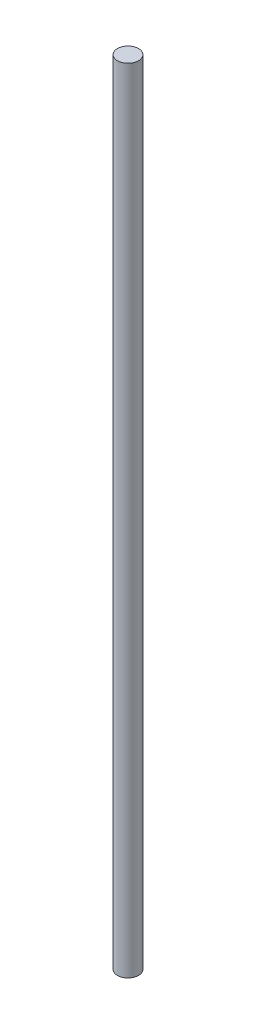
from build123d import *

# Parameters (mm, degrees)
SKETCH1_R           = 4
BOSS_EXTRUDE1_DEPTH = 300


with BuildPart() as part:
    # Sketch1 → Boss-Extrude1 (new body)
    with BuildSketch(Plane(origin=(0, 0, 0), x_dir=(1, 0, 0), z_dir=(0, 1, 0))):
        with Locations(Location((0, 0, 0), (0, 0, 270))):
            Circle(SKETCH1_R)
    extrude(amount=BOSS_EXTRUDE1_DEPTH)


solid = part.part
